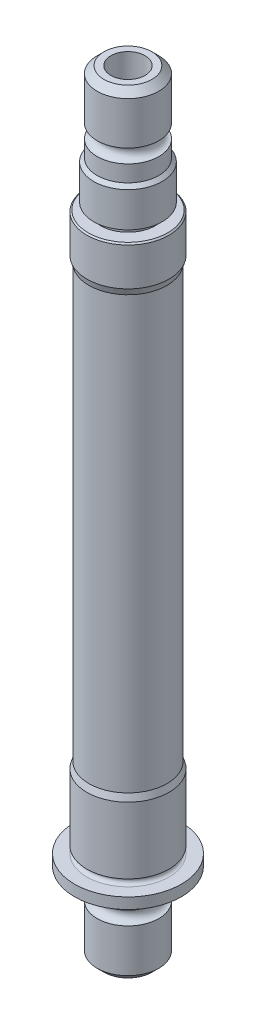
ISO-10303-21;
HEADER;
FILE_DESCRIPTION(('STEP AP214'),'2;1');
FILE_NAME('part.step','',(''),(''),'','','');
FILE_SCHEMA(('AUTOMOTIVE_DESIGN { 1 0 10303 214 1 1 1 1 }'));
ENDSEC;
DATA;
#1=APPLICATION_CONTEXT('core data for automotive mechanical design processes');
#2=APPLICATION_PROTOCOL_DEFINITION('international standard','automotive_design',2000,#1);
#3=PRODUCT_CONTEXT('',#1,'mechanical');
#4=PRODUCT('Part','Part','',(#3));
#5=PRODUCT_RELATED_PRODUCT_CATEGORY('part','',(#4));
#6=PRODUCT_DEFINITION_FORMATION('','',#4);
#7=PRODUCT_DEFINITION_CONTEXT('part definition',#1,'design');
#8=PRODUCT_DEFINITION('design','',#6,#7);
#9=PRODUCT_DEFINITION_SHAPE('','',#8);
#10=(LENGTH_UNIT() NAMED_UNIT(*) SI_UNIT(.MILLI.,.METRE.));
#11=(NAMED_UNIT(*) PLANE_ANGLE_UNIT() SI_UNIT($,.RADIAN.));
#12=(NAMED_UNIT(*) SI_UNIT($,.STERADIAN.) SOLID_ANGLE_UNIT());
#13=UNCERTAINTY_MEASURE_WITH_UNIT(LENGTH_MEASURE(1.E-05),#10,'distance_accuracy_value','');
#14=(GEOMETRIC_REPRESENTATION_CONTEXT(3) GLOBAL_UNCERTAINTY_ASSIGNED_CONTEXT((#13)) GLOBAL_UNIT_ASSIGNED_CONTEXT((#10,
#11,#12)) REPRESENTATION_CONTEXT('',''));
#15=CARTESIAN_POINT('',(0.,0.,0.));
#16=DIRECTION('',(0.,0.,1.));
#17=DIRECTION('',(1.,0.,0.));
#18=AXIS2_PLACEMENT_3D('',#15,#16,#17);
#19=CARTESIAN_POINT('',(4.25610053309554E-11,-112.900475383,0.));
#20=DIRECTION('',(0.,1.,0.));
#21=DIRECTION('',(0.,0.,1.));
#22=AXIS2_PLACEMENT_3D('',#19,#20,#21);
#23=CONICAL_SURFACE('',#22,4.49999999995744,0.785398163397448);
#24=CARTESIAN_POINT('',(4.25610053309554E-11,-113.900475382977,0.));
#25=DIRECTION('',(0.,1.,0.));
#26=DIRECTION('',(0.,0.,1.));
#27=AXIS2_PLACEMENT_3D('',#24,#25,#26);
#28=CIRCLE('',#27,3.49999999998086);
#29=CARTESIAN_POINT('',(4.25610053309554E-11,-113.900475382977,3.49999999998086));
#30=VERTEX_POINT('',#29);
#31=EDGE_CURVE('E132',#30,#30,#28,.T.);
#32=ORIENTED_EDGE('',*,*,#31,.T.);
#33=EDGE_LOOP('',(#32));
#34=FACE_BOUND('',#33,.T.);
#35=CARTESIAN_POINT('',(4.25610053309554E-11,-112.900475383,0.));
#36=DIRECTION('',(0.,1.,0.));
#37=DIRECTION('',(0.,0.,1.));
#38=AXIS2_PLACEMENT_3D('',#35,#36,#37);
#39=CIRCLE('',#38,4.49999999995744);
#40=CARTESIAN_POINT('',(4.25610053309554E-11,-112.900475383,4.49999999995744));
#41=VERTEX_POINT('',#40);
#42=EDGE_CURVE('E11',#41,#41,#39,.T.);
#43=ORIENTED_EDGE('',*,*,#42,.F.);
#44=EDGE_LOOP('',(#43));
#45=FACE_BOUND('',#44,.T.);
#46=ADVANCED_FACE('F30',(#34,#45),#23,.T.);
#47=CARTESIAN_POINT('',(4.25610053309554E-11,-113.900475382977,0.));
#48=DIRECTION('',(0.,1.,0.));
#49=DIRECTION('',(0.,0.,1.));
#50=AXIS2_PLACEMENT_3D('',#47,#48,#49);
#51=CYLINDRICAL_SURFACE('',#50,4.49999999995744);
#52=ORIENTED_EDGE('',*,*,#42,.T.);
#53=EDGE_LOOP('',(#52));
#54=FACE_BOUND('',#53,.T.);
#55=CARTESIAN_POINT('',(4.25610053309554E-11,-106.610475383,0.));
#56=DIRECTION('',(0.,1.,0.));
#57=DIRECTION('',(0.,0.,1.));
#58=AXIS2_PLACEMENT_3D('',#55,#56,#57);
#59=CIRCLE('',#58,4.49999999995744);
#60=CARTESIAN_POINT('',(4.25610053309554E-11,-106.610475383,4.49999999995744));
#61=VERTEX_POINT('',#60);
#62=EDGE_CURVE('E37',#61,#61,#59,.T.);
#63=ORIENTED_EDGE('',*,*,#62,.F.);
#64=EDGE_LOOP('',(#63));
#65=FACE_BOUND('',#64,.T.);
#66=ADVANCED_FACE('F208',(#54,#65),#51,.T.);
#67=CARTESIAN_POINT('',(4.2560573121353E-11,-105.610475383,0.));
#68=DIRECTION('',(0.,1.,0.));
#69=DIRECTION('',(0.,0.,1.));
#70=AXIS2_PLACEMENT_3D('',#67,#68,#69);
#71=TOROIDAL_SURFACE('',#70,4.49999999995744,1.);
#72=ORIENTED_EDGE('',*,*,#62,.T.);
#73=EDGE_LOOP('',(#72));
#74=FACE_BOUND('',#73,.T.);
#75=CARTESIAN_POINT('',(4.25610053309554E-11,-104.610475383,0.));
#76=DIRECTION('',(0.,1.,0.));
#77=DIRECTION('',(0.,0.,1.));
#78=AXIS2_PLACEMENT_3D('',#75,#76,#77);
#79=CIRCLE('',#78,4.49999999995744);
#80=CARTESIAN_POINT('',(4.25610053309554E-11,-104.610475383,4.49999999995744));
#81=VERTEX_POINT('',#80);
#82=EDGE_CURVE('E200',#81,#81,#79,.T.);
#83=ORIENTED_EDGE('',*,*,#82,.F.);
#84=EDGE_LOOP('',(#83));
#85=FACE_BOUND('',#84,.T.);
#86=ADVANCED_FACE('F205',(#74,#85),#71,.F.);
#87=CARTESIAN_POINT('',(4.25610053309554E-11,-113.900475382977,0.));
#88=DIRECTION('',(0.,1.,0.));
#89=DIRECTION('',(0.,0.,1.));
#90=AXIS2_PLACEMENT_3D('',#87,#88,#89);
#91=CYLINDRICAL_SURFACE('',#90,4.49999999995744);
#92=ORIENTED_EDGE('',*,*,#82,.T.);
#93=EDGE_LOOP('',(#92));
#94=FACE_BOUND('',#93,.T.);
#95=CARTESIAN_POINT('',(4.25610053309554E-11,-102.210475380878,0.));
#96=DIRECTION('',(0.,1.,0.));
#97=DIRECTION('',(0.,0.,1.));
#98=AXIS2_PLACEMENT_3D('',#95,#96,#97);
#99=CIRCLE('',#98,4.49999999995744);
#100=CARTESIAN_POINT('',(4.25610053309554E-11,-102.210475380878,4.49999999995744));
#101=VERTEX_POINT('',#100);
#102=EDGE_CURVE('E197',#101,#101,#99,.T.);
#103=ORIENTED_EDGE('',*,*,#102,.F.);
#104=EDGE_LOOP('',(#103));
#105=FACE_BOUND('',#104,.T.);
#106=ADVANCED_FACE('F215',(#94,#105),#91,.T.);
#107=CARTESIAN_POINT('',(7.79999999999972,-102.210475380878,0.));
#108=DIRECTION('',(0.,-1.,0.));
#109=DIRECTION('',(0.,0.,-1.));
#110=AXIS2_PLACEMENT_3D('',#107,#108,#109);
#111=PLANE('',#110);
#112=ORIENTED_EDGE('',*,*,#102,.T.);
#113=EDGE_LOOP('',(#112));
#114=FACE_BOUND('',#113,.T.);
#115=CARTESIAN_POINT('',(4.25610053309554E-11,-102.210475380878,0.));
#116=DIRECTION('',(0.,1.,0.));
#117=DIRECTION('',(0.,0.,1.));
#118=AXIS2_PLACEMENT_3D('',#115,#116,#117);
#119=CIRCLE('',#118,7.79999999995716);
#120=CARTESIAN_POINT('',(4.25610053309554E-11,-102.210475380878,7.79999999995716));
#121=VERTEX_POINT('',#120);
#122=EDGE_CURVE('E194',#121,#121,#119,.T.);
#123=ORIENTED_EDGE('',*,*,#122,.F.);
#124=EDGE_LOOP('',(#123));
#125=FACE_BOUND('',#124,.T.);
#126=ADVANCED_FACE('F221',(#114,#125),#111,.T.);
#127=CARTESIAN_POINT('',(4.25610053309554E-11,-113.900475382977,0.));
#128=DIRECTION('',(0.,1.,0.));
#129=DIRECTION('',(0.,0.,1.));
#130=AXIS2_PLACEMENT_3D('',#127,#128,#129);
#131=CYLINDRICAL_SURFACE('',#130,7.79999999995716);
#132=ORIENTED_EDGE('',*,*,#122,.T.);
#133=EDGE_LOOP('',(#132));
#134=FACE_BOUND('',#133,.T.);
#135=CARTESIAN_POINT('',(4.25610053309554E-11,-100.610475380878,0.));
#136=DIRECTION('',(0.,1.,0.));
#137=DIRECTION('',(0.,0.,1.));
#138=AXIS2_PLACEMENT_3D('',#135,#136,#137);
#139=CIRCLE('',#138,7.79999999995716);
#140=CARTESIAN_POINT('',(4.25610053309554E-11,-100.610475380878,7.79999999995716));
#141=VERTEX_POINT('',#140);
#142=EDGE_CURVE('E191',#141,#141,#139,.T.);
#143=ORIENTED_EDGE('',*,*,#142,.F.);
#144=EDGE_LOOP('',(#143));
#145=FACE_BOUND('',#144,.T.);
#146=ADVANCED_FACE('F225',(#134,#145),#131,.T.);
#147=CARTESIAN_POINT('',(6.00006515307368,-100.610475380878,0.));
#148=DIRECTION('',(0.,1.,0.));
#149=DIRECTION('',(0.,0.,1.));
#150=AXIS2_PLACEMENT_3D('',#147,#148,#149);
#151=PLANE('',#150);
#152=ORIENTED_EDGE('',*,*,#142,.T.);
#153=EDGE_LOOP('',(#152));
#154=FACE_BOUND('',#153,.T.);
#155=CARTESIAN_POINT('',(4.25610053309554E-11,-100.610475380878,0.));
#156=DIRECTION('',(0.,1.,0.));
#157=DIRECTION('',(0.,0.,1.));
#158=AXIS2_PLACEMENT_3D('',#155,#156,#157);
#159=CIRCLE('',#158,6.00006515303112);
#160=CARTESIAN_POINT('',(4.25610053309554E-11,-100.610475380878,6.00006515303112));
#161=VERTEX_POINT('',#160);
#162=EDGE_CURVE('E188',#161,#161,#159,.T.);
#163=ORIENTED_EDGE('',*,*,#162,.F.);
#164=EDGE_LOOP('',(#163));
#165=FACE_BOUND('',#164,.T.);
#166=ADVANCED_FACE('F229',(#154,#165),#151,.T.);
#167=CARTESIAN_POINT('',(4.2560573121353E-11,-100.110475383,0.));
#168=DIRECTION('',(0.,1.,0.));
#169=DIRECTION('',(0.,0.,1.));
#170=AXIS2_PLACEMENT_3D('',#167,#168,#169);
#171=TOROIDAL_SURFACE('',#170,5.99999999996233,0.500000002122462);
#172=ORIENTED_EDGE('',*,*,#162,.T.);
#173=EDGE_LOOP('',(#172));
#174=FACE_BOUND('',#173,.T.);
#175=CARTESIAN_POINT('',(4.25610053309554E-11,-99.6104753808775,0.));
#176=DIRECTION('',(0.,1.,0.));
#177=DIRECTION('',(0.,0.,1.));
#178=AXIS2_PLACEMENT_3D('',#175,#176,#177);
#179=CIRCLE('',#178,5.99999999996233);
#180=CARTESIAN_POINT('',(4.25610053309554E-11,-99.6104753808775,5.99999999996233));
#181=VERTEX_POINT('',#180);
#182=EDGE_CURVE('E185',#181,#181,#179,.T.);
#183=ORIENTED_EDGE('',*,*,#182,.F.);
#184=EDGE_LOOP('',(#183));
#185=FACE_BOUND('',#184,.T.);
#186=ADVANCED_FACE('F233',(#174,#185),#171,.F.);
#187=CARTESIAN_POINT('',(4.25610053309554E-11,-113.900475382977,0.));
#188=DIRECTION('',(0.,1.,0.));
#189=DIRECTION('',(0.,0.,1.));
#190=AXIS2_PLACEMENT_3D('',#187,#188,#189);
#191=CYLINDRICAL_SURFACE('',#190,5.99999999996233);
#192=ORIENTED_EDGE('',*,*,#182,.T.);
#193=EDGE_LOOP('',(#192));
#194=FACE_BOUND('',#193,.T.);
#195=CARTESIAN_POINT('',(4.25610053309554E-11,-89.9004753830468,0.));
#196=DIRECTION('',(0.,1.,0.));
#197=DIRECTION('',(0.,0.,1.));
#198=AXIS2_PLACEMENT_3D('',#195,#196,#197);
#199=CIRCLE('',#198,5.99999999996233);
#200=CARTESIAN_POINT('',(4.25610053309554E-11,-89.9004753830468,5.99999999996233));
#201=VERTEX_POINT('',#200);
#202=EDGE_CURVE('E182',#201,#201,#199,.T.);
#203=ORIENTED_EDGE('',*,*,#202,.F.);
#204=EDGE_LOOP('',(#203));
#205=FACE_BOUND('',#204,.T.);
#206=ADVANCED_FACE('F237',(#194,#205),#191,.T.);
#207=CARTESIAN_POINT('',(4.25610053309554E-11,-88.9465361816,0.));
#208=DIRECTION('',(0.,-1.,0.));
#209=DIRECTION('',(0.,0.,-1.));
#210=AXIS2_PLACEMENT_3D('',#207,#208,#209);
#211=CONICAL_SURFACE('',#210,5.69999999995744,0.304692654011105);
#212=ORIENTED_EDGE('',*,*,#202,.T.);
#213=EDGE_LOOP('',(#212));
#214=FACE_BOUND('',#213,.T.);
#215=CARTESIAN_POINT('',(4.25610053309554E-11,-88.9465361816,0.));
#216=DIRECTION('',(0.,1.,0.));
#217=DIRECTION('',(0.,0.,1.));
#218=AXIS2_PLACEMENT_3D('',#215,#216,#217);
#219=CIRCLE('',#218,5.69999999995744);
#220=CARTESIAN_POINT('',(4.25610053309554E-11,-88.9465361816,5.69999999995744));
#221=VERTEX_POINT('',#220);
#222=EDGE_CURVE('E179',#221,#221,#219,.T.);
#223=ORIENTED_EDGE('',*,*,#222,.F.);
#224=EDGE_LOOP('',(#223));
#225=FACE_BOUND('',#224,.T.);
#226=ADVANCED_FACE('F241',(#214,#225),#211,.T.);
#227=CARTESIAN_POINT('',(4.25610053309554E-11,-113.900475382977,0.));
#228=DIRECTION('',(0.,1.,0.));
#229=DIRECTION('',(0.,0.,1.));
#230=AXIS2_PLACEMENT_3D('',#227,#228,#229);
#231=CYLINDRICAL_SURFACE('',#230,5.69999999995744);
#232=ORIENTED_EDGE('',*,*,#222,.T.);
#233=EDGE_LOOP('',(#232));
#234=FACE_BOUND('',#233,.T.);
#235=CARTESIAN_POINT('',(4.25610053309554E-11,-25.9544145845,0.));
#236=DIRECTION('',(0.,1.,0.));
#237=DIRECTION('',(0.,0.,1.));
#238=AXIS2_PLACEMENT_3D('',#235,#236,#237);
#239=CIRCLE('',#238,5.69999999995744);
#240=CARTESIAN_POINT('',(4.25610053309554E-11,-25.9544145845,5.69999999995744));
#241=VERTEX_POINT('',#240);
#242=EDGE_CURVE('E176',#241,#241,#239,.T.);
#243=ORIENTED_EDGE('',*,*,#242,.F.);
#244=EDGE_LOOP('',(#243));
#245=FACE_BOUND('',#244,.T.);
#246=ADVANCED_FACE('F245',(#234,#245),#231,.T.);
#247=CARTESIAN_POINT('',(4.25610053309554E-11,-25.0004753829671,0.));
#248=DIRECTION('',(0.,1.,0.));
#249=DIRECTION('',(0.,0.,1.));
#250=AXIS2_PLACEMENT_3D('',#247,#248,#249);
#251=CONICAL_SURFACE('',#250,5.99999999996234,0.304692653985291);
#252=ORIENTED_EDGE('',*,*,#242,.T.);
#253=EDGE_LOOP('',(#252));
#254=FACE_BOUND('',#253,.T.);
#255=CARTESIAN_POINT('',(4.25610053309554E-11,-25.0004753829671,0.));
#256=DIRECTION('',(0.,1.,0.));
#257=DIRECTION('',(0.,0.,1.));
#258=AXIS2_PLACEMENT_3D('',#255,#256,#257);
#259=CIRCLE('',#258,5.99999999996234);
#260=CARTESIAN_POINT('',(4.25610053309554E-11,-25.0004753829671,5.99999999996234));
#261=VERTEX_POINT('',#260);
#262=EDGE_CURVE('E173',#261,#261,#259,.T.);
#263=ORIENTED_EDGE('',*,*,#262,.F.);
#264=EDGE_LOOP('',(#263));
#265=FACE_BOUND('',#264,.T.);
#266=ADVANCED_FACE('F249',(#254,#265),#251,.T.);
#267=CARTESIAN_POINT('',(4.25610053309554E-11,-113.900475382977,0.));
#268=DIRECTION('',(0.,1.,0.));
#269=DIRECTION('',(0.,0.,1.));
#270=AXIS2_PLACEMENT_3D('',#267,#268,#269);
#271=CYLINDRICAL_SURFACE('',#270,5.99999999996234);
#272=ORIENTED_EDGE('',*,*,#262,.T.);
#273=EDGE_LOOP('',(#272));
#274=FACE_BOUND('',#273,.T.);
#275=CARTESIAN_POINT('',(4.25610053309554E-11,-19.4509507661,0.));
#276=DIRECTION('',(0.,1.,0.));
#277=DIRECTION('',(0.,0.,1.));
#278=AXIS2_PLACEMENT_3D('',#275,#276,#277);
#279=CIRCLE('',#278,5.99999999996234);
#280=CARTESIAN_POINT('',(4.25610053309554E-11,-19.4509507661,5.99999999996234));
#281=VERTEX_POINT('',#280);
#282=EDGE_CURVE('E170',#281,#281,#279,.T.);
#283=ORIENTED_EDGE('',*,*,#282,.F.);
#284=EDGE_LOOP('',(#283));
#285=FACE_BOUND('',#284,.T.);
#286=ADVANCED_FACE('F253',(#274,#285),#271,.T.);
#287=CARTESIAN_POINT('',(4.25610053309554E-11,-19.2509507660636,0.));
#288=DIRECTION('',(0.,-1.,0.));
#289=DIRECTION('',(0.,0.,-1.));
#290=AXIS2_PLACEMENT_3D('',#287,#288,#289);
#291=CONICAL_SURFACE('',#290,5.79999999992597,0.785398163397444);
#292=ORIENTED_EDGE('',*,*,#282,.T.);
#293=EDGE_LOOP('',(#292));
#294=FACE_BOUND('',#293,.T.);
#295=CARTESIAN_POINT('',(4.25610053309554E-11,-19.2509507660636,0.));
#296=DIRECTION('',(0.,1.,0.));
#297=DIRECTION('',(0.,0.,1.));
#298=AXIS2_PLACEMENT_3D('',#295,#296,#297);
#299=CIRCLE('',#298,5.79999999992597);
#300=CARTESIAN_POINT('',(4.25610053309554E-11,-19.2509507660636,5.79999999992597));
#301=VERTEX_POINT('',#300);
#302=EDGE_CURVE('E167',#301,#301,#299,.T.);
#303=ORIENTED_EDGE('',*,*,#302,.F.);
#304=EDGE_LOOP('',(#303));
#305=FACE_BOUND('',#304,.T.);
#306=ADVANCED_FACE('F257',(#294,#305),#291,.T.);
#307=CARTESIAN_POINT('',(4.00000000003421,-19.2509507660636,0.));
#308=DIRECTION('',(0.,1.,0.));
#309=DIRECTION('',(0.,0.,1.));
#310=AXIS2_PLACEMENT_3D('',#307,#308,#309);
#311=PLANE('',#310);
#312=ORIENTED_EDGE('',*,*,#302,.T.);
#313=EDGE_LOOP('',(#312));
#314=FACE_BOUND('',#313,.T.);
#315=CARTESIAN_POINT('',(4.25610053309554E-11,-19.2509507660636,0.));
#316=DIRECTION('',(0.,1.,0.));
#317=DIRECTION('',(0.,0.,1.));
#318=AXIS2_PLACEMENT_3D('',#315,#316,#317);
#319=CIRCLE('',#318,3.99999999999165);
#320=CARTESIAN_POINT('',(4.25610053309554E-11,-19.2509507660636,3.99999999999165));
#321=VERTEX_POINT('',#320);
#322=EDGE_CURVE('E164',#321,#321,#319,.T.);
#323=ORIENTED_EDGE('',*,*,#322,.F.);
#324=EDGE_LOOP('',(#323));
#325=FACE_BOUND('',#324,.T.);
#326=ADVANCED_FACE('F261',(#314,#325),#311,.T.);
#327=CARTESIAN_POINT('',(4.25610053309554E-11,-113.900475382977,0.));
#328=DIRECTION('',(0.,1.,0.));
#329=DIRECTION('',(0.,0.,1.));
#330=AXIS2_PLACEMENT_3D('',#327,#328,#329);
#331=CYLINDRICAL_SURFACE('',#330,3.99999999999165);
#332=ORIENTED_EDGE('',*,*,#322,.T.);
#333=EDGE_LOOP('',(#332));
#334=FACE_BOUND('',#333,.T.);
#335=CARTESIAN_POINT('',(4.25610053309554E-11,-18.2509507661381,0.));
#336=DIRECTION('',(0.,1.,0.));
#337=DIRECTION('',(0.,0.,1.));
#338=AXIS2_PLACEMENT_3D('',#335,#336,#337);
#339=CIRCLE('',#338,3.99999999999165);
#340=CARTESIAN_POINT('',(4.25610053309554E-11,-18.2509507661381,3.99999999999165));
#341=VERTEX_POINT('',#340);
#342=EDGE_CURVE('E161',#341,#341,#339,.T.);
#343=ORIENTED_EDGE('',*,*,#342,.F.);
#344=EDGE_LOOP('',(#343));
#345=FACE_BOUND('',#344,.T.);
#346=ADVANCED_FACE('F265',(#334,#345),#331,.T.);
#347=CARTESIAN_POINT('',(4.99999999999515,-18.2509507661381,0.));
#348=DIRECTION('',(0.,-1.,0.));
#349=DIRECTION('',(0.,0.,-1.));
#350=AXIS2_PLACEMENT_3D('',#347,#348,#349);
#351=PLANE('',#350);
#352=ORIENTED_EDGE('',*,*,#342,.T.);
#353=EDGE_LOOP('',(#352));
#354=FACE_BOUND('',#353,.T.);
#355=CARTESIAN_POINT('',(4.25610053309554E-11,-18.2509507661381,0.));
#356=DIRECTION('',(0.,1.,0.));
#357=DIRECTION('',(0.,0.,1.));
#358=AXIS2_PLACEMENT_3D('',#355,#356,#357);
#359=CIRCLE('',#358,4.99999999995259);
#360=CARTESIAN_POINT('',(4.25610053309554E-11,-18.2509507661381,4.99999999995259));
#361=VERTEX_POINT('',#360);
#362=EDGE_CURVE('E158',#361,#361,#359,.T.);
#363=ORIENTED_EDGE('',*,*,#362,.F.);
#364=EDGE_LOOP('',(#363));
#365=FACE_BOUND('',#364,.T.);
#366=ADVANCED_FACE('F269',(#354,#365),#351,.T.);
#367=CARTESIAN_POINT('',(4.25610053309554E-11,-113.900475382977,0.));
#368=DIRECTION('',(0.,1.,0.));
#369=DIRECTION('',(0.,0.,1.));
#370=AXIS2_PLACEMENT_3D('',#367,#368,#369);
#371=CYLINDRICAL_SURFACE('',#370,4.99999999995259);
#372=ORIENTED_EDGE('',*,*,#362,.T.);
#373=EDGE_LOOP('',(#372));
#374=FACE_BOUND('',#373,.T.);
#375=CARTESIAN_POINT('',(4.25610053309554E-11,-13.1569507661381,0.));
#376=DIRECTION('',(0.,1.,0.));
#377=DIRECTION('',(0.,0.,1.));
#378=AXIS2_PLACEMENT_3D('',#375,#376,#377);
#379=CIRCLE('',#378,4.99999999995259);
#380=CARTESIAN_POINT('',(4.25610053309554E-11,-13.1569507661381,4.99999999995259));
#381=VERTEX_POINT('',#380);
#382=EDGE_CURVE('E155',#381,#381,#379,.T.);
#383=ORIENTED_EDGE('',*,*,#382,.F.);
#384=EDGE_LOOP('',(#383));
#385=FACE_BOUND('',#384,.T.);
#386=ADVANCED_FACE('F273',(#374,#385),#371,.T.);
#387=CARTESIAN_POINT('',(4.25610053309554E-11,-12.6569507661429,0.));
#388=DIRECTION('',(0.,-1.,0.));
#389=DIRECTION('',(0.,0.,-1.));
#390=AXIS2_PLACEMENT_3D('',#387,#388,#389);
#391=CONICAL_SURFACE('',#390,4.49999999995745,0.785398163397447);
#392=ORIENTED_EDGE('',*,*,#382,.T.);
#393=EDGE_LOOP('',(#392));
#394=FACE_BOUND('',#393,.T.);
#395=CARTESIAN_POINT('',(4.25610053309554E-11,-12.6569507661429,0.));
#396=DIRECTION('',(0.,1.,0.));
#397=DIRECTION('',(0.,0.,1.));
#398=AXIS2_PLACEMENT_3D('',#395,#396,#397);
#399=CIRCLE('',#398,4.49999999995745);
#400=CARTESIAN_POINT('',(4.25610053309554E-11,-12.6569507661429,4.49999999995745));
#401=VERTEX_POINT('',#400);
#402=EDGE_CURVE('E152',#401,#401,#399,.T.);
#403=ORIENTED_EDGE('',*,*,#402,.F.);
#404=EDGE_LOOP('',(#403));
#405=FACE_BOUND('',#404,.T.);
#406=ADVANCED_FACE('F277',(#394,#405),#391,.T.);
#407=CARTESIAN_POINT('',(4.25610053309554E-11,-113.900475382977,0.));
#408=DIRECTION('',(0.,1.,0.));
#409=DIRECTION('',(0.,0.,1.));
#410=AXIS2_PLACEMENT_3D('',#407,#408,#409);
#411=CYLINDRICAL_SURFACE('',#410,4.49999999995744);
#412=ORIENTED_EDGE('',*,*,#402,.T.);
#413=EDGE_LOOP('',(#412));
#414=FACE_BOUND('',#413,.T.);
#415=CARTESIAN_POINT('',(4.25610053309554E-11,-10.2569507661,0.));
#416=DIRECTION('',(0.,1.,0.));
#417=DIRECTION('',(0.,0.,1.));
#418=AXIS2_PLACEMENT_3D('',#415,#416,#417);
#419=CIRCLE('',#418,4.49999999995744);
#420=CARTESIAN_POINT('',(4.25610053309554E-11,-10.2569507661,4.49999999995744));
#421=VERTEX_POINT('',#420);
#422=EDGE_CURVE('E149',#421,#421,#419,.T.);
#423=ORIENTED_EDGE('',*,*,#422,.F.);
#424=EDGE_LOOP('',(#423));
#425=FACE_BOUND('',#424,.T.);
#426=ADVANCED_FACE('F281',(#414,#425),#411,.T.);
#427=CARTESIAN_POINT('',(4.2560573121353E-11,-9.2569507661,0.));
#428=DIRECTION('',(0.,1.,0.));
#429=DIRECTION('',(0.,0.,1.));
#430=AXIS2_PLACEMENT_3D('',#427,#428,#429);
#431=TOROIDAL_SURFACE('',#430,4.49999999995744,0.999999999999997);
#432=ORIENTED_EDGE('',*,*,#422,.T.);
#433=EDGE_LOOP('',(#432));
#434=FACE_BOUND('',#433,.T.);
#435=CARTESIAN_POINT('',(4.25610053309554E-11,-8.2569507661,0.));
#436=DIRECTION('',(0.,1.,0.));
#437=DIRECTION('',(0.,0.,1.));
#438=AXIS2_PLACEMENT_3D('',#435,#436,#437);
#439=CIRCLE('',#438,4.49999999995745);
#440=CARTESIAN_POINT('',(4.25610053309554E-11,-8.2569507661,4.49999999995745));
#441=VERTEX_POINT('',#440);
#442=EDGE_CURVE('E146',#441,#441,#439,.T.);
#443=ORIENTED_EDGE('',*,*,#442,.F.);
#444=EDGE_LOOP('',(#443));
#445=FACE_BOUND('',#444,.T.);
#446=ADVANCED_FACE('F285',(#434,#445),#431,.F.);
#447=CARTESIAN_POINT('',(4.25610053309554E-11,-113.900475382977,0.));
#448=DIRECTION('',(0.,1.,0.));
#449=DIRECTION('',(0.,0.,1.));
#450=AXIS2_PLACEMENT_3D('',#447,#448,#449);
#451=CYLINDRICAL_SURFACE('',#450,4.49999999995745);
#452=ORIENTED_EDGE('',*,*,#442,.T.);
#453=EDGE_LOOP('',(#452));
#454=FACE_BOUND('',#453,.T.);
#455=CARTESIAN_POINT('',(4.25610053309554E-11,-2.00047538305,0.));
#456=DIRECTION('',(0.,1.,0.));
#457=DIRECTION('',(0.,0.,1.));
#458=AXIS2_PLACEMENT_3D('',#455,#456,#457);
#459=CIRCLE('',#458,4.49999999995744);
#460=CARTESIAN_POINT('',(4.25610053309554E-11,-2.00047538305,4.49999999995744));
#461=VERTEX_POINT('',#460);
#462=EDGE_CURVE('E143',#461,#461,#459,.T.);
#463=ORIENTED_EDGE('',*,*,#462,.F.);
#464=EDGE_LOOP('',(#463));
#465=FACE_BOUND('',#464,.T.);
#466=ADVANCED_FACE('F289',(#454,#465),#451,.T.);
#467=CARTESIAN_POINT('',(4.25610053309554E-11,-1.0004753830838,0.));
#468=DIRECTION('',(0.,-1.,0.));
#469=DIRECTION('',(0.,0.,-1.));
#470=AXIS2_PLACEMENT_3D('',#467,#468,#469);
#471=CONICAL_SURFACE('',#470,3.49999999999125,0.785398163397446);
#472=ORIENTED_EDGE('',*,*,#462,.T.);
#473=EDGE_LOOP('',(#472));
#474=FACE_BOUND('',#473,.T.);
#475=CARTESIAN_POINT('',(4.25610053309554E-11,-1.0004753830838,0.));
#476=DIRECTION('',(0.,1.,0.));
#477=DIRECTION('',(0.,0.,1.));
#478=AXIS2_PLACEMENT_3D('',#475,#476,#477);
#479=CIRCLE('',#478,3.49999999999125);
#480=CARTESIAN_POINT('',(4.25610053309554E-11,-1.0004753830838,3.49999999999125));
#481=VERTEX_POINT('',#480);
#482=EDGE_CURVE('E140',#481,#481,#479,.T.);
#483=ORIENTED_EDGE('',*,*,#482,.F.);
#484=EDGE_LOOP('',(#483));
#485=FACE_BOUND('',#484,.T.);
#486=ADVANCED_FACE('F293',(#474,#485),#471,.T.);
#487=CARTESIAN_POINT('',(4.25610053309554E-11,-1.0004753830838,0.));
#488=DIRECTION('',(0.,1.,0.));
#489=DIRECTION('',(0.,0.,1.));
#490=AXIS2_PLACEMENT_3D('',#487,#488,#489);
#491=PLANE('',#490);
#492=CARTESIAN_POINT('',(0.,-1.00047538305,0.));
#493=DIRECTION('',(0.,-1.,0.));
#494=DIRECTION('',(0.,0.,-1.));
#495=AXIS2_PLACEMENT_3D('',#492,#493,#494);
#496=CIRCLE('',#495,2.5);
#497=CARTESIAN_POINT('',(0.,-1.00047538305,-2.5));
#498=VERTEX_POINT('',#497);
#499=EDGE_CURVE('E119',#498,#498,#496,.T.);
#500=ORIENTED_EDGE('',*,*,#499,.T.);
#501=EDGE_LOOP('',(#500));
#502=FACE_BOUND('',#501,.T.);
#503=ORIENTED_EDGE('',*,*,#482,.T.);
#504=EDGE_LOOP('',(#503));
#505=FACE_BOUND('',#504,.T.);
#506=ADVANCED_FACE('F297',(#502,#505),#491,.T.);
#507=CARTESIAN_POINT('',(3.50000000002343,-113.900475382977,0.));
#508=DIRECTION('',(0.,-1.,0.));
#509=DIRECTION('',(0.,0.,-1.));
#510=AXIS2_PLACEMENT_3D('',#507,#508,#509);
#511=PLANE('',#510);
#512=DIRECTION('',(1.,0.,0.));
#513=VECTOR('',#512,1.);
#514=CARTESIAN_POINT('',(-1.7320508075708,-113.900475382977,-3.00000000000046));
#515=LINE('',#514,#513);
#516=CARTESIAN_POINT('',(-1.7320508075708,-113.900475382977,-3.00000000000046));
#517=VERTEX_POINT('',#516);
#518=CARTESIAN_POINT('',(1.7320508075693,-113.900475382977,-3.00000000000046));
#519=VERTEX_POINT('',#518);
#520=EDGE_CURVE('E44',#517,#519,#515,.T.);
#521=ORIENTED_EDGE('',*,*,#520,.F.);
#522=DIRECTION('',(0.5,0.,-0.866025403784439));
#523=VECTOR('',#522,1.);
#524=CARTESIAN_POINT('',(-3.46410161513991,-113.900475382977,0.));
#525=LINE('',#524,#523);
#526=CARTESIAN_POINT('',(-3.46410161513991,-113.900475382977,0.));
#527=VERTEX_POINT('',#526);
#528=EDGE_CURVE('E128',#527,#517,#525,.T.);
#529=ORIENTED_EDGE('',*,*,#528,.F.);
#530=DIRECTION('',(-0.5,0.,-0.866025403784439));
#531=VECTOR('',#530,1.);
#532=CARTESIAN_POINT('',(-1.73205080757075,-113.900475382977,3.00000000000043));
#533=LINE('',#532,#531);
#534=CARTESIAN_POINT('',(-1.73205080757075,-113.900475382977,3.00000000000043));
#535=VERTEX_POINT('',#534);
#536=EDGE_CURVE('E126',#535,#527,#533,.T.);
#537=ORIENTED_EDGE('',*,*,#536,.F.);
#538=DIRECTION('',(-1.,0.,0.));
#539=VECTOR('',#538,1.);
#540=CARTESIAN_POINT('',(1.73205080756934,-113.900475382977,3.00000000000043));
#541=LINE('',#540,#539);
#542=CARTESIAN_POINT('',(1.73205080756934,-113.900475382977,3.00000000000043));
#543=VERTEX_POINT('',#542);
#544=EDGE_CURVE('E92',#543,#535,#541,.T.);
#545=ORIENTED_EDGE('',*,*,#544,.F.);
#546=DIRECTION('',(-0.5,0.,0.866025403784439));
#547=VECTOR('',#546,1.);
#548=CARTESIAN_POINT('',(3.46410161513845,-113.900475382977,0.));
#549=LINE('',#548,#547);
#550=CARTESIAN_POINT('',(3.46410161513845,-113.900475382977,0.));
#551=VERTEX_POINT('',#550);
#552=EDGE_CURVE('E122',#551,#543,#549,.T.);
#553=ORIENTED_EDGE('',*,*,#552,.F.);
#554=DIRECTION('',(0.5,0.,0.866025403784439));
#555=VECTOR('',#554,1.);
#556=CARTESIAN_POINT('',(1.7320508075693,-113.900475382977,-3.00000000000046));
#557=LINE('',#556,#555);
#558=EDGE_CURVE('E118',#519,#551,#557,.T.);
#559=ORIENTED_EDGE('',*,*,#558,.F.);
#560=EDGE_LOOP('',(#521,#529,#537,#545,#553,#559));
#561=FACE_BOUND('',#560,.T.);
#562=ORIENTED_EDGE('',*,*,#31,.F.);
#563=EDGE_LOOP('',(#562));
#564=FACE_BOUND('',#563,.T.);
#565=ADVANCED_FACE('F301',(#561,#564),#511,.T.);
#566=CARTESIAN_POINT('',(-1.7320508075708,-110.900475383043,-3.00000000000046));
#567=DIRECTION('',(0.,0.,-1.));
#568=DIRECTION('',(-1.,0.,0.));
#569=AXIS2_PLACEMENT_3D('',#566,#567,#568);
#570=PLANE('',#569);
#571=ORIENTED_EDGE('',*,*,#520,.T.);
#572=DIRECTION('',(0.,-1.,0.));
#573=VECTOR('',#572,1.);
#574=CARTESIAN_POINT('',(1.7320508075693,-110.900475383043,-3.00000000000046));
#575=LINE('',#574,#573);
#576=CARTESIAN_POINT('',(1.7320508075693,-110.900475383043,-3.00000000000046));
#577=VERTEX_POINT('',#576);
#578=EDGE_CURVE('E74',#577,#519,#575,.T.);
#579=ORIENTED_EDGE('',*,*,#578,.F.);
#580=DIRECTION('',(1.,0.,0.));
#581=VECTOR('',#580,1.);
#582=CARTESIAN_POINT('',(-1.7320508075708,-110.900475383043,-3.00000000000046));
#583=LINE('',#582,#581);
#584=CARTESIAN_POINT('',(-1.7320508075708,-110.900475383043,-3.00000000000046));
#585=VERTEX_POINT('',#584);
#586=EDGE_CURVE('E130',#585,#577,#583,.T.);
#587=ORIENTED_EDGE('',*,*,#586,.F.);
#588=DIRECTION('',(0.,-1.,0.));
#589=VECTOR('',#588,1.);
#590=CARTESIAN_POINT('',(-1.7320508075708,-110.900475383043,-3.00000000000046));
#591=LINE('',#590,#589);
#592=EDGE_CURVE('E52',#585,#517,#591,.T.);
#593=ORIENTED_EDGE('',*,*,#592,.T.);
#594=EDGE_LOOP('',(#571,#579,#587,#593));
#595=FACE_BOUND('',#594,.T.);
#596=ADVANCED_FACE('F305',(#595),#570,.F.);
#597=CARTESIAN_POINT('',(-3.46410161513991,-110.900475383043,0.));
#598=DIRECTION('',(-0.866025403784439,0.,-0.5));
#599=DIRECTION('',(-0.5,0.,0.866025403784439));
#600=AXIS2_PLACEMENT_3D('',#597,#598,#599);
#601=PLANE('',#600);
#602=ORIENTED_EDGE('',*,*,#528,.T.);
#603=ORIENTED_EDGE('',*,*,#592,.F.);
#604=DIRECTION('',(0.5,0.,-0.866025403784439));
#605=VECTOR('',#604,1.);
#606=CARTESIAN_POINT('',(-3.46410161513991,-110.900475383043,0.));
#607=LINE('',#606,#605);
#608=CARTESIAN_POINT('',(-3.46410161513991,-110.900475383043,0.));
#609=VERTEX_POINT('',#608);
#610=EDGE_CURVE('E104',#609,#585,#607,.T.);
#611=ORIENTED_EDGE('',*,*,#610,.F.);
#612=DIRECTION('',(0.,-1.,0.));
#613=VECTOR('',#612,1.);
#614=CARTESIAN_POINT('',(-3.46410161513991,-110.900475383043,0.));
#615=LINE('',#614,#613);
#616=EDGE_CURVE('E96',#609,#527,#615,.T.);
#617=ORIENTED_EDGE('',*,*,#616,.T.);
#618=EDGE_LOOP('',(#602,#603,#611,#617));
#619=FACE_BOUND('',#618,.T.);
#620=ADVANCED_FACE('F309',(#619),#601,.F.);
#621=CARTESIAN_POINT('',(-1.73205080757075,-110.900475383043,3.00000000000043));
#622=DIRECTION('',(-0.866025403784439,0.,0.5));
#623=DIRECTION('',(0.5,0.,0.866025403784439));
#624=AXIS2_PLACEMENT_3D('',#621,#622,#623);
#625=PLANE('',#624);
#626=ORIENTED_EDGE('',*,*,#536,.T.);
#627=ORIENTED_EDGE('',*,*,#616,.F.);
#628=DIRECTION('',(-0.5,0.,-0.866025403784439));
#629=VECTOR('',#628,1.);
#630=CARTESIAN_POINT('',(-1.73205080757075,-110.900475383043,3.00000000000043));
#631=LINE('',#630,#629);
#632=CARTESIAN_POINT('',(-1.73205080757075,-110.900475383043,3.00000000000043));
#633=VERTEX_POINT('',#632);
#634=EDGE_CURVE('E100',#633,#609,#631,.T.);
#635=ORIENTED_EDGE('',*,*,#634,.F.);
#636=DIRECTION('',(0.,-1.,0.));
#637=VECTOR('',#636,1.);
#638=CARTESIAN_POINT('',(-1.73205080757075,-110.900475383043,3.00000000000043));
#639=LINE('',#638,#637);
#640=EDGE_CURVE('E85',#633,#535,#639,.T.);
#641=ORIENTED_EDGE('',*,*,#640,.T.);
#642=EDGE_LOOP('',(#626,#627,#635,#641));
#643=FACE_BOUND('',#642,.T.);
#644=ADVANCED_FACE('F101',(#643),#625,.F.);
#645=CARTESIAN_POINT('',(1.73205080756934,-110.900475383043,3.00000000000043));
#646=DIRECTION('',(0.,0.,1.));
#647=DIRECTION('',(1.,0.,0.));
#648=AXIS2_PLACEMENT_3D('',#645,#646,#647);
#649=PLANE('',#648);
#650=ORIENTED_EDGE('',*,*,#544,.T.);
#651=ORIENTED_EDGE('',*,*,#640,.F.);
#652=DIRECTION('',(-1.,0.,0.));
#653=VECTOR('',#652,1.);
#654=CARTESIAN_POINT('',(1.73205080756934,-110.900475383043,3.00000000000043));
#655=LINE('',#654,#653);
#656=CARTESIAN_POINT('',(1.73205080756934,-110.900475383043,3.00000000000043));
#657=VERTEX_POINT('',#656);
#658=EDGE_CURVE('E89',#657,#633,#655,.T.);
#659=ORIENTED_EDGE('',*,*,#658,.F.);
#660=DIRECTION('',(0.,-1.,0.));
#661=VECTOR('',#660,1.);
#662=CARTESIAN_POINT('',(1.73205080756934,-110.900475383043,3.00000000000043));
#663=LINE('',#662,#661);
#664=EDGE_CURVE('E97',#657,#543,#663,.T.);
#665=ORIENTED_EDGE('',*,*,#664,.T.);
#666=EDGE_LOOP('',(#650,#651,#659,#665));
#667=FACE_BOUND('',#666,.T.);
#668=ADVANCED_FACE('F87',(#667),#649,.F.);
#669=CARTESIAN_POINT('',(3.46410161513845,-110.900475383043,0.));
#670=DIRECTION('',(0.866025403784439,0.,0.5));
#671=DIRECTION('',(0.5,0.,-0.866025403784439));
#672=AXIS2_PLACEMENT_3D('',#669,#670,#671);
#673=PLANE('',#672);
#674=ORIENTED_EDGE('',*,*,#552,.T.);
#675=ORIENTED_EDGE('',*,*,#664,.F.);
#676=DIRECTION('',(-0.5,0.,0.866025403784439));
#677=VECTOR('',#676,1.);
#678=CARTESIAN_POINT('',(3.46410161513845,-110.900475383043,0.));
#679=LINE('',#678,#677);
#680=CARTESIAN_POINT('',(3.46410161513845,-110.900475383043,0.));
#681=VERTEX_POINT('',#680);
#682=EDGE_CURVE('E110',#681,#657,#679,.T.);
#683=ORIENTED_EDGE('',*,*,#682,.F.);
#684=DIRECTION('',(0.,-1.,0.));
#685=VECTOR('',#684,1.);
#686=CARTESIAN_POINT('',(3.46410161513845,-110.900475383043,0.));
#687=LINE('',#686,#685);
#688=EDGE_CURVE('E135',#681,#551,#687,.T.);
#689=ORIENTED_EDGE('',*,*,#688,.T.);
#690=EDGE_LOOP('',(#674,#675,#683,#689));
#691=FACE_BOUND('',#690,.T.);
#692=ADVANCED_FACE('F313',(#691),#673,.F.);
#693=CARTESIAN_POINT('',(1.7320508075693,-110.900475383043,-3.00000000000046));
#694=DIRECTION('',(0.866025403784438,0.,-0.5));
#695=DIRECTION('',(-0.5,0.,-0.866025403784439));
#696=AXIS2_PLACEMENT_3D('',#693,#694,#695);
#697=PLANE('',#696);
#698=ORIENTED_EDGE('',*,*,#558,.T.);
#699=ORIENTED_EDGE('',*,*,#688,.F.);
#700=DIRECTION('',(0.5,0.,0.866025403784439));
#701=VECTOR('',#700,1.);
#702=CARTESIAN_POINT('',(1.7320508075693,-110.900475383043,-3.00000000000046));
#703=LINE('',#702,#701);
#704=EDGE_CURVE('E112',#577,#681,#703,.T.);
#705=ORIENTED_EDGE('',*,*,#704,.F.);
#706=ORIENTED_EDGE('',*,*,#578,.T.);
#707=EDGE_LOOP('',(#698,#699,#705,#706));
#708=FACE_BOUND('',#707,.T.);
#709=ADVANCED_FACE('F310',(#708),#697,.F.);
#710=CARTESIAN_POINT('',(1.7320508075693,-110.900475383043,-3.00000000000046));
#711=DIRECTION('',(0.,-1.,0.));
#712=DIRECTION('',(0.,0.,-1.));
#713=AXIS2_PLACEMENT_3D('',#710,#711,#712);
#714=PLANE('',#713);
#715=CARTESIAN_POINT('',(0.,-110.900475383,0.));
#716=DIRECTION('',(0.,-1.,0.));
#717=DIRECTION('',(0.,0.,-1.));
#718=AXIS2_PLACEMENT_3D('',#715,#716,#717);
#719=CIRCLE('',#718,2.5);
#720=CARTESIAN_POINT('',(0.,-110.900475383,-2.5));
#721=VERTEX_POINT('',#720);
#722=EDGE_CURVE('E337',#721,#721,#719,.T.);
#723=ORIENTED_EDGE('',*,*,#722,.F.);
#724=EDGE_LOOP('',(#723));
#725=FACE_BOUND('',#724,.T.);
#726=ORIENTED_EDGE('',*,*,#586,.T.);
#727=ORIENTED_EDGE('',*,*,#704,.T.);
#728=ORIENTED_EDGE('',*,*,#682,.T.);
#729=ORIENTED_EDGE('',*,*,#658,.T.);
#730=ORIENTED_EDGE('',*,*,#634,.T.);
#731=ORIENTED_EDGE('',*,*,#610,.T.);
#732=EDGE_LOOP('',(#726,#727,#728,#729,#730,#731));
#733=FACE_BOUND('',#732,.T.);
#734=ADVANCED_FACE('F107',(#725,#733),#714,.T.);
#735=CARTESIAN_POINT('',(0.,-1.00047538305,0.));
#736=DIRECTION('',(0.,-1.,0.));
#737=DIRECTION('',(0.,0.,-1.));
#738=AXIS2_PLACEMENT_3D('',#735,#736,#737);
#739=CYLINDRICAL_SURFACE('',#738,2.5);
#740=ORIENTED_EDGE('',*,*,#499,.F.);
#741=EDGE_LOOP('',(#740));
#742=FACE_BOUND('',#741,.T.);
#743=ORIENTED_EDGE('',*,*,#722,.T.);
#744=EDGE_LOOP('',(#743));
#745=FACE_BOUND('',#744,.T.);
#746=ADVANCED_FACE('F326',(#742,#745),#739,.F.);
#747=CLOSED_SHELL('',(#46,#66,#86,#106,#126,#146,#166,#186,#206,#226,#246,#266,#286,#306,#326,
#346,#366,#386,#406,#426,#446,#466,#486,#506,#565,#596,#620,#644,#668,#692,#709,#734,#746));
#748=MANIFOLD_SOLID_BREP('B2',#747);
#749=ADVANCED_BREP_SHAPE_REPRESENTATION('',(#18,#748),#14);
#750=SHAPE_DEFINITION_REPRESENTATION(#9,#749);
ENDSEC;
END-ISO-10303-21;
